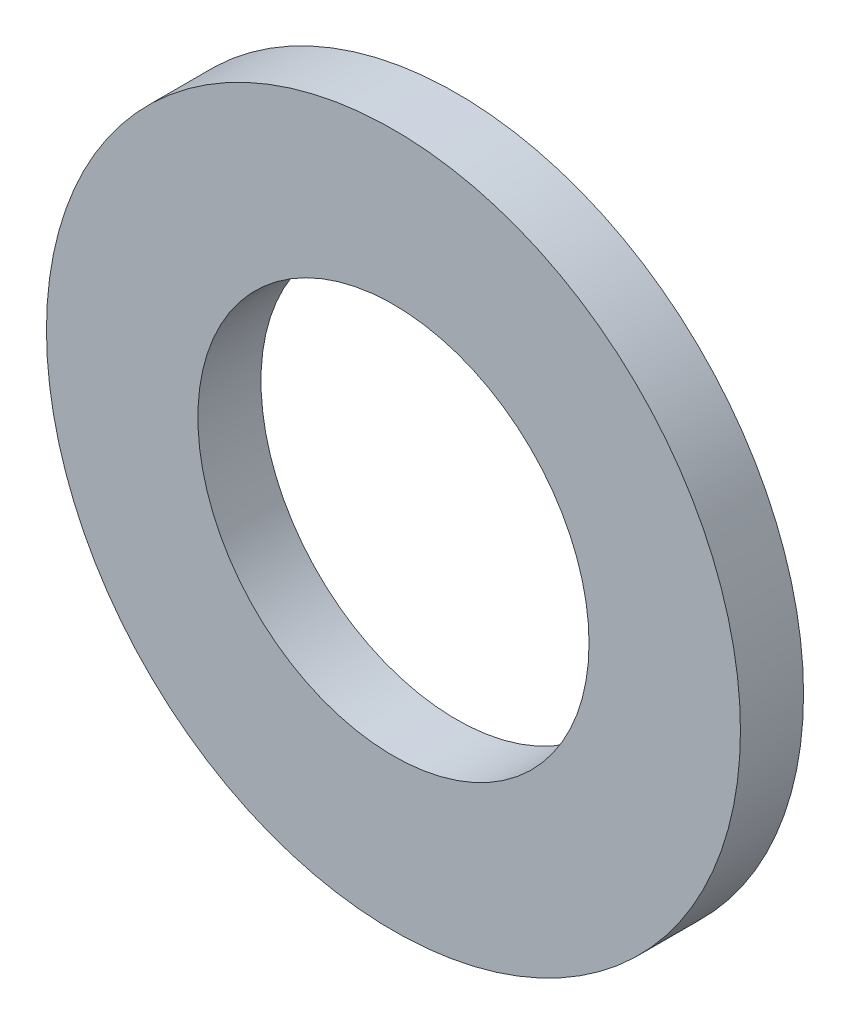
ISO-10303-21;
HEADER;
FILE_DESCRIPTION(('STEP AP214'),'2;1');
FILE_NAME('part.step','',(''),(''),'','','');
FILE_SCHEMA(('AUTOMOTIVE_DESIGN { 1 0 10303 214 1 1 1 1 }'));
ENDSEC;
DATA;
#1=APPLICATION_CONTEXT('core data for automotive mechanical design processes');
#2=APPLICATION_PROTOCOL_DEFINITION('international standard','automotive_design',2000,#1);
#3=PRODUCT_CONTEXT('',#1,'mechanical');
#4=PRODUCT('Part','Part','',(#3));
#5=PRODUCT_RELATED_PRODUCT_CATEGORY('part','',(#4));
#6=PRODUCT_DEFINITION_FORMATION('','',#4);
#7=PRODUCT_DEFINITION_CONTEXT('part definition',#1,'design');
#8=PRODUCT_DEFINITION('design','',#6,#7);
#9=PRODUCT_DEFINITION_SHAPE('','',#8);
#10=(LENGTH_UNIT() NAMED_UNIT(*) SI_UNIT(.MILLI.,.METRE.));
#11=(NAMED_UNIT(*) PLANE_ANGLE_UNIT() SI_UNIT($,.RADIAN.));
#12=(NAMED_UNIT(*) SI_UNIT($,.STERADIAN.) SOLID_ANGLE_UNIT());
#13=UNCERTAINTY_MEASURE_WITH_UNIT(LENGTH_MEASURE(1.E-05),#10,'distance_accuracy_value','');
#14=(GEOMETRIC_REPRESENTATION_CONTEXT(3) GLOBAL_UNCERTAINTY_ASSIGNED_CONTEXT((#13)) GLOBAL_UNIT_ASSIGNED_CONTEXT((#10,
#11,#12)) REPRESENTATION_CONTEXT('',''));
#15=CARTESIAN_POINT('',(0.,0.,0.));
#16=DIRECTION('',(0.,0.,1.));
#17=DIRECTION('',(1.,0.,0.));
#18=AXIS2_PLACEMENT_3D('',#15,#16,#17);
#19=CARTESIAN_POINT('',(0.,0.,5.));
#20=DIRECTION('',(0.,0.,1.));
#21=DIRECTION('',(1.,0.,0.));
#22=AXIS2_PLACEMENT_3D('',#19,#20,#21);
#23=PLANE('',#22);
#24=CARTESIAN_POINT('',(0.,0.,5.));
#25=DIRECTION('',(0.,0.,1.));
#26=DIRECTION('',(1.,0.,0.));
#27=AXIS2_PLACEMENT_3D('',#24,#25,#26);
#28=CIRCLE('',#27,27.5);
#29=CARTESIAN_POINT('',(27.5,0.,5.));
#30=VERTEX_POINT('',#29);
#31=EDGE_CURVE('E10',#30,#30,#28,.T.);
#32=ORIENTED_EDGE('',*,*,#31,.T.);
#33=EDGE_LOOP('',(#32));
#34=FACE_BOUND('',#33,.T.);
#35=CARTESIAN_POINT('',(0.,0.,5.));
#36=DIRECTION('',(0.,0.,1.));
#37=DIRECTION('',(1.,0.,0.));
#38=AXIS2_PLACEMENT_3D('',#35,#36,#37);
#39=CIRCLE('',#38,15.5);
#40=CARTESIAN_POINT('',(15.5,0.,5.));
#41=VERTEX_POINT('',#40);
#42=EDGE_CURVE('E40',#41,#41,#39,.T.);
#43=ORIENTED_EDGE('',*,*,#42,.F.);
#44=EDGE_LOOP('',(#43));
#45=FACE_BOUND('',#44,.T.);
#46=ADVANCED_FACE('F29',(#34,#45),#23,.T.);
#47=CARTESIAN_POINT('',(0.,0.,0.));
#48=DIRECTION('',(0.,0.,1.));
#49=DIRECTION('',(1.,0.,0.));
#50=AXIS2_PLACEMENT_3D('',#47,#48,#49);
#51=PLANE('',#50);
#52=CARTESIAN_POINT('',(0.,0.,0.));
#53=DIRECTION('',(0.,0.,1.));
#54=DIRECTION('',(1.,0.,0.));
#55=AXIS2_PLACEMENT_3D('',#52,#53,#54);
#56=CIRCLE('',#55,27.5);
#57=CARTESIAN_POINT('',(27.5,0.,0.));
#58=VERTEX_POINT('',#57);
#59=EDGE_CURVE('E33',#58,#58,#56,.T.);
#60=ORIENTED_EDGE('',*,*,#59,.F.);
#61=EDGE_LOOP('',(#60));
#62=FACE_BOUND('',#61,.T.);
#63=CARTESIAN_POINT('',(0.,0.,0.));
#64=DIRECTION('',(0.,0.,1.));
#65=DIRECTION('',(1.,0.,0.));
#66=AXIS2_PLACEMENT_3D('',#63,#64,#65);
#67=CIRCLE('',#66,15.5);
#68=CARTESIAN_POINT('',(15.5,0.,0.));
#69=VERTEX_POINT('',#68);
#70=EDGE_CURVE('E42',#69,#69,#67,.T.);
#71=ORIENTED_EDGE('',*,*,#70,.T.);
#72=EDGE_LOOP('',(#71));
#73=FACE_BOUND('',#72,.T.);
#74=ADVANCED_FACE('F52',(#62,#73),#51,.F.);
#75=CARTESIAN_POINT('',(0.,0.,5.));
#76=DIRECTION('',(0.,0.,-1.));
#77=DIRECTION('',(-1.,0.,0.));
#78=AXIS2_PLACEMENT_3D('',#75,#76,#77);
#79=CYLINDRICAL_SURFACE('',#78,27.5);
#80=ORIENTED_EDGE('',*,*,#31,.F.);
#81=EDGE_LOOP('',(#80));
#82=FACE_BOUND('',#81,.T.);
#83=ORIENTED_EDGE('',*,*,#59,.T.);
#84=EDGE_LOOP('',(#83));
#85=FACE_BOUND('',#84,.T.);
#86=ADVANCED_FACE('F31',(#82,#85),#79,.T.);
#87=CARTESIAN_POINT('',(0.,0.,5.));
#88=DIRECTION('',(0.,0.,-1.));
#89=DIRECTION('',(-1.,0.,0.));
#90=AXIS2_PLACEMENT_3D('',#87,#88,#89);
#91=CYLINDRICAL_SURFACE('',#90,15.5);
#92=ORIENTED_EDGE('',*,*,#42,.T.);
#93=EDGE_LOOP('',(#92));
#94=FACE_BOUND('',#93,.T.);
#95=ORIENTED_EDGE('',*,*,#70,.F.);
#96=EDGE_LOOP('',(#95));
#97=FACE_BOUND('',#96,.T.);
#98=ADVANCED_FACE('F48',(#94,#97),#91,.F.);
#99=CLOSED_SHELL('',(#46,#74,#86,#98));
#100=MANIFOLD_SOLID_BREP('B2',#99);
#101=ADVANCED_BREP_SHAPE_REPRESENTATION('',(#18,#100),#14);
#102=SHAPE_DEFINITION_REPRESENTATION(#9,#101);
ENDSEC;
END-ISO-10303-21;
